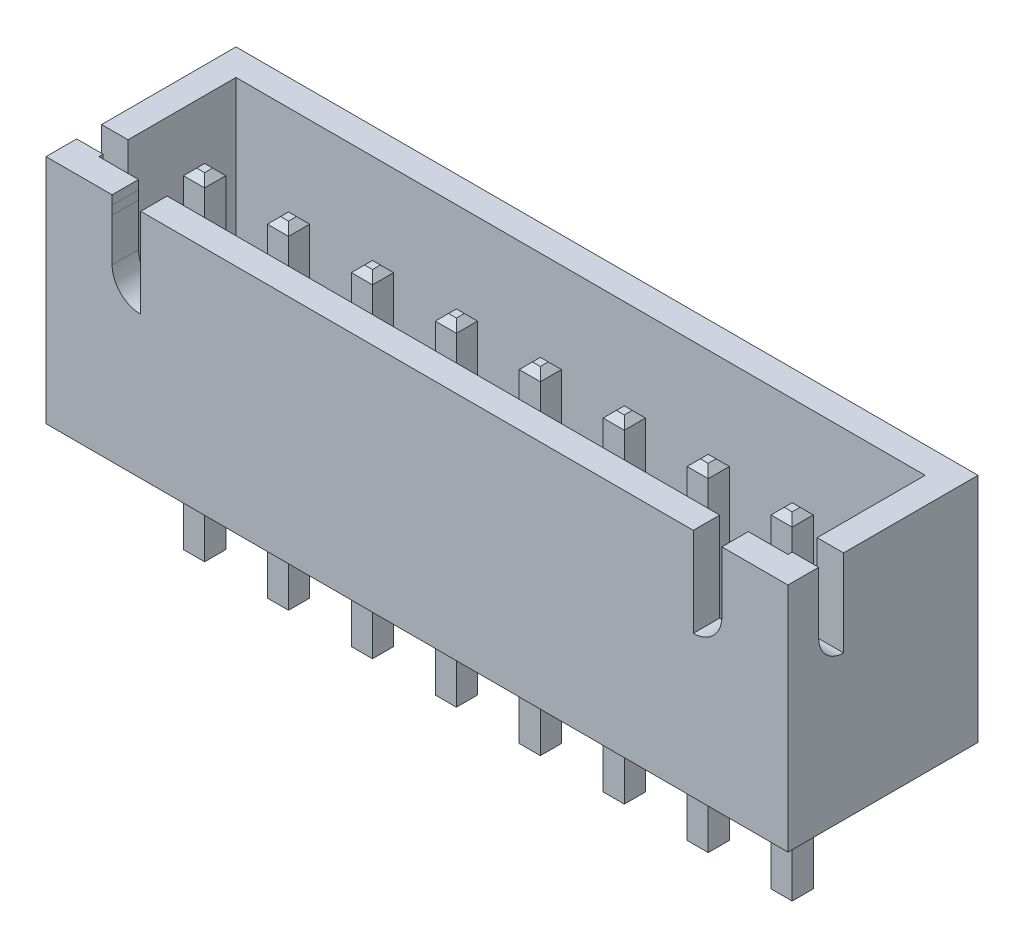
from build123d import *

# Parameters (mm, degrees)
SKETCH1_W                = 22.4536
SKETCH1_H                = 5.75
BOSS_EXTRUDE1_DEPTH      = 7
SHELL1_T                 = -0.8
CUT_EXTRUDE1_DEPTH       = 24.694509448
CUT_EXTRUDE2_REACH       = 16.426
BOSS_EXTRUDE2_DEPTH      = 3.45
BOSS_EXTRUDE2_DEPTH_BACK = 6.75
SKETCH4_W                = 0.64
SKETCH4_H                = 0.64
CHAMFER1_SIZE            = 0.2


with BuildPart() as part:
    # Sketch1 → Boss-Extrude1 (new body)
    with BuildSketch(Plane(origin=(0, 0, 0), x_dir=(1, 0, 0), z_dir=(0, 1, 0))):
        Rectangle(SKETCH1_W, SKETCH1_H)
    extrude(amount=BOSS_EXTRUDE1_DEPTH)

    # Shell1
    shell1_openings = [part.faces().sort_by_distance(p)[0] for p in [
        (0, 7, 0),
    ]]
    offset(amount=SHELL1_T, openings=shell1_openings, kind=Kind.INTERSECTION)

    # Sketch2 → Cut-Extrude1 (cut, through all)
    with BuildSketch(Plane(origin=(11.2268, 0, 0), x_dir=(0, 0, -1), z_dir=(1, 0, 0))):
        with BuildLine():
            Line((-1.19301282, 7), (-1.19301282, 4.379603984))
            ThreePointArc((-1.19301282, 4.379603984), (-1.72610374, 4.600417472), (-1.946917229, 5.133508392))
            Line((-1.946917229, 5.133508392), (-1.946917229, 7))
            Line((-1.946917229, 7), (-1.19301282, 7))
        make_face()
    extrude(amount=-CUT_EXTRUDE1_DEPTH, mode=Mode.SUBTRACT)

    # Sketch3 → Cut-Extrude2 (cut, up to next)
    with BuildSketch(Plane.XY.offset(2.875), mode=Mode.PRIVATE) as cut_extrude2_sk1:
        with BuildLine():
            Line((-9.2268, 7), (-9.2268, 6.728922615))
            Line((-9.2268, 6.728922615), (-9.2268, 6.463895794))
            Line((-9.2268, 6.463895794), (-9.2268, 5.166308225))
            ThreePointArc((-9.2268, 5.166308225), (-8.973086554, 4.553789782), (-8.36056811, 4.300076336))
            Line((-8.36056811, 4.300076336), (-8.36056811, 7))
            Line((-8.36056811, 7), (-9.2268, 7))
        make_face()
    cut_extrude2_tool1 = extrude(cut_extrude2_sk1.sketch, amount=-CUT_EXTRUDE2_REACH, mode=Mode.PRIVATE) & part.part
    # Sketch3 → Cut-Extrude2 (cut, up to next)
    with BuildSketch(Plane.XY.offset(2.875), mode=Mode.PRIVATE) as cut_extrude2_sk2:
        with BuildLine():
            Line((8.36056811, 7), (9.2268, 7))
            Line((9.2268, 7), (9.227261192, 6.728921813))
            Line((9.227261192, 6.728921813), (9.2268, 6.463895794))
            Line((9.2268, 6.463895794), (9.2268, 5.166308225))
            ThreePointArc((9.2268, 5.166308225), (8.973086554, 4.553789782), (8.36056811, 4.300076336))
            Line((8.36056811, 4.300076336), (8.36056811, 7))
        make_face()
    cut_extrude2_tool2 = extrude(cut_extrude2_sk2.sketch, amount=-CUT_EXTRUDE2_REACH, mode=Mode.PRIVATE) & part.part
    add(cut_extrude2_tool1.solids().sort_by_distance((-8.775965, 5.735551, 2.875))[0], mode=Mode.SUBTRACT)
    add(cut_extrude2_tool2.solids().sort_by_distance((8.775991, 5.735608, 2.875))[0], mode=Mode.SUBTRACT)

    # Sketch4 → Boss-Extrude2 (add, two sides: drawn at the far end of the back side and taken through both)
    with BuildSketch(Plane.XZ.offset(-BOSS_EXTRUDE2_DEPTH_BACK)):
        with Locations((-8.7768, 0.525)):
            Rectangle(SKETCH4_W, SKETCH4_H)
        with Locations((-6.2368, 0.525)):
            Rectangle(SKETCH4_W, SKETCH4_H)
        with Locations((-3.6968, 0.525)):
            Rectangle(SKETCH4_W, SKETCH4_H)
        with Locations((-1.1568, 0.525)):
            Rectangle(SKETCH4_W, SKETCH4_H)
        with Locations((1.3832, 0.525)):
            Rectangle(SKETCH4_W, SKETCH4_H)
        with Locations((3.9232, 0.525)):
            Rectangle(SKETCH4_W, SKETCH4_H)
        with Locations((6.4632, 0.525)):
            Rectangle(SKETCH4_W, SKETCH4_H)
        with Locations((9.0032, 0.525)):
            Rectangle(SKETCH4_W, SKETCH4_H)
    extrude(amount=BOSS_EXTRUDE2_DEPTH + BOSS_EXTRUDE2_DEPTH_BACK)

    # Chamfer1
    chamfer1_edges = [part.edges().sort_by_distance(p)[0] for p in [
        (-8.4568, 6.75, 0.525),
        (-8.7768, 6.75, 0.205),
        (-9.0968, 6.75, 0.525),
        (-8.7768, 6.75, 0.845),
        (-8.4568, -3.45, 0.525),
        (-8.7768, -3.45, 0.845),
        (-9.0968, -3.45, 0.525),
        (-8.7768, -3.45, 0.205),
        (-5.9168, 6.75, 0.525),
        (-6.2368, 6.75, 0.205),
        (-6.5568, 6.75, 0.525),
        (-6.2368, 6.75, 0.845),
        (-5.9168, -3.45, 0.525),
        (-6.2368, -3.45, 0.845),
        (-6.5568, -3.45, 0.525),
        (-6.2368, -3.45, 0.205),
        (-3.3768, 6.75, 0.525),
        (-3.6968, 6.75, 0.205),
        (-4.0168, 6.75, 0.525),
        (-3.6968, 6.75, 0.845),
        (-3.3768, -3.45, 0.525),
        (-3.6968, -3.45, 0.845),
        (-4.0168, -3.45, 0.525),
        (-3.6968, -3.45, 0.205),
        (-0.8368, 6.75, 0.525),
        (-1.1568, 6.75, 0.205),
        (-1.4768, 6.75, 0.525),
        (-1.1568, 6.75, 0.845),
        (-0.8368, -3.45, 0.525),
        (-1.1568, -3.45, 0.845),
        (-1.4768, -3.45, 0.525),
        (-1.1568, -3.45, 0.205),
        (1.7032, 6.75, 0.525),
        (1.3832, 6.75, 0.205),
        (1.0632, 6.75, 0.525),
        (1.3832, 6.75, 0.845),
        (1.7032, -3.45, 0.525),
        (1.3832, -3.45, 0.845),
        (1.0632, -3.45, 0.525),
        (1.3832, -3.45, 0.205),
        (4.2432, 6.75, 0.525),
        (3.9232, 6.75, 0.205),
        (3.6032, 6.75, 0.525),
        (3.9232, 6.75, 0.845),
        (4.2432, -3.45, 0.525),
        (3.9232, -3.45, 0.845),
        (3.6032, -3.45, 0.525),
        (3.9232, -3.45, 0.205),
        (6.7832, 6.75, 0.525),
        (6.4632, 6.75, 0.205),
        (6.1432, 6.75, 0.525),
        (6.4632, 6.75, 0.845),
        (6.7832, -3.45, 0.525),
        (6.4632, -3.45, 0.845),
        (6.1432, -3.45, 0.525),
        (6.4632, -3.45, 0.205),
        (9.3232, 6.75, 0.525),
        (9.0032, 6.75, 0.205),
        (8.6832, 6.75, 0.525),
        (9.0032, 6.75, 0.845),
        (9.3232, -3.45, 0.525),
        (9.0032, -3.45, 0.845),
        (8.6832, -3.45, 0.525),
        (9.0032, -3.45, 0.205),
    ]]
    chamfer(chamfer1_edges, length=CHAMFER1_SIZE)


solid = part.part
